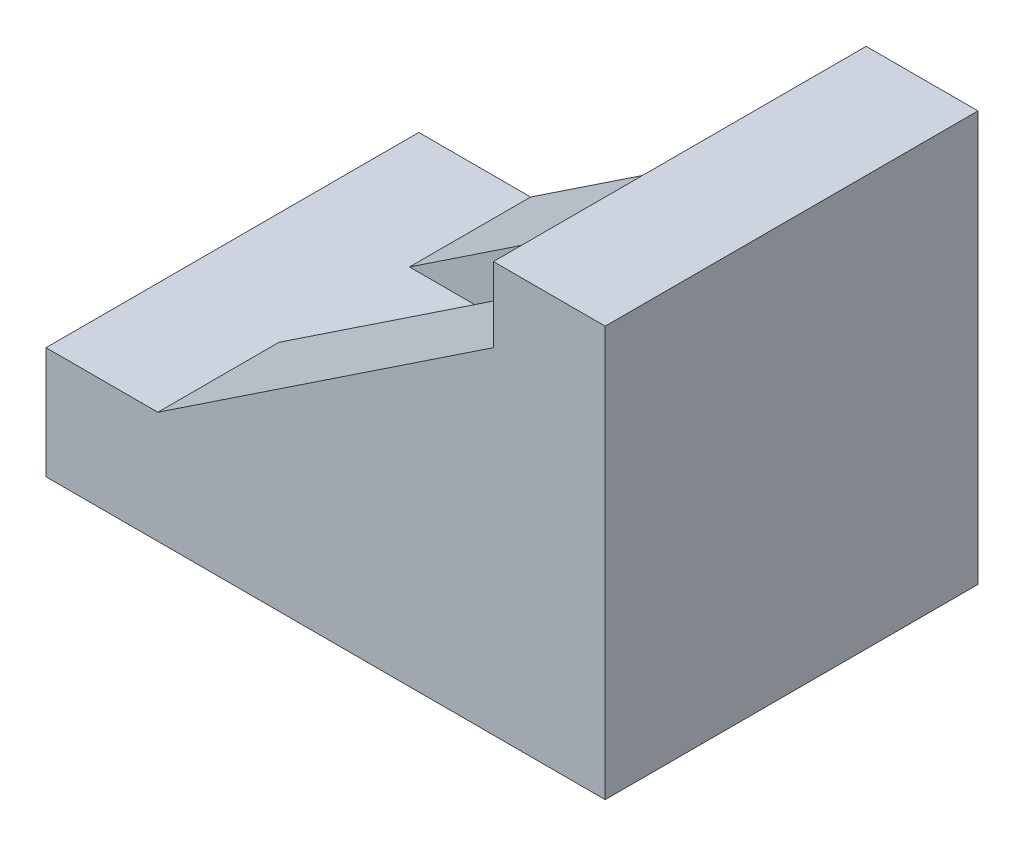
ISO-10303-21;
HEADER;
FILE_DESCRIPTION(('STEP AP214'),'2;1');
FILE_NAME('part.step','',(''),(''),'','','');
FILE_SCHEMA(('AUTOMOTIVE_DESIGN { 1 0 10303 214 1 1 1 1 }'));
ENDSEC;
DATA;
#1=APPLICATION_CONTEXT('core data for automotive mechanical design processes');
#2=APPLICATION_PROTOCOL_DEFINITION('international standard','automotive_design',2000,#1);
#3=PRODUCT_CONTEXT('',#1,'mechanical');
#4=PRODUCT('Part','Part','',(#3));
#5=PRODUCT_RELATED_PRODUCT_CATEGORY('part','',(#4));
#6=PRODUCT_DEFINITION_FORMATION('','',#4);
#7=PRODUCT_DEFINITION_CONTEXT('part definition',#1,'design');
#8=PRODUCT_DEFINITION('design','',#6,#7);
#9=PRODUCT_DEFINITION_SHAPE('','',#8);
#10=(LENGTH_UNIT() NAMED_UNIT(*) SI_UNIT(.MILLI.,.METRE.));
#11=(NAMED_UNIT(*) PLANE_ANGLE_UNIT() SI_UNIT($,.RADIAN.));
#12=(NAMED_UNIT(*) SI_UNIT($,.STERADIAN.) SOLID_ANGLE_UNIT());
#13=UNCERTAINTY_MEASURE_WITH_UNIT(LENGTH_MEASURE(1.E-05),#10,'distance_accuracy_value','');
#14=(GEOMETRIC_REPRESENTATION_CONTEXT(3) GLOBAL_UNCERTAINTY_ASSIGNED_CONTEXT((#13)) GLOBAL_UNIT_ASSIGNED_CONTEXT((#10,
#11,#12)) REPRESENTATION_CONTEXT('',''));
#15=CARTESIAN_POINT('',(0.,0.,0.));
#16=DIRECTION('',(0.,0.,1.));
#17=DIRECTION('',(1.,0.,0.));
#18=AXIS2_PLACEMENT_3D('',#15,#16,#17);
#19=CARTESIAN_POINT('',(24.,18.,10.));
#20=DIRECTION('',(0.554700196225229,-0.832050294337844,0.));
#21=DIRECTION('',(0.832050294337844,0.554700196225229,0.));
#22=AXIS2_PLACEMENT_3D('',#19,#20,#21);
#23=PLANE('',#22);
#24=DIRECTION('',(-0.832050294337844,-0.554700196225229,0.));
#25=VECTOR('',#24,1.);
#26=CARTESIAN_POINT('',(24.,18.,-3.5));
#27=LINE('',#26,#25);
#28=CARTESIAN_POINT('',(24.,18.,-3.5));
#29=VERTEX_POINT('',#28);
#30=CARTESIAN_POINT('',(6.,6.,-3.5));
#31=VERTEX_POINT('',#30);
#32=EDGE_CURVE('E46',#29,#31,#27,.T.);
#33=ORIENTED_EDGE('',*,*,#32,.F.);
#34=DIRECTION('',(0.,0.,-1.));
#35=VECTOR('',#34,1.);
#36=CARTESIAN_POINT('',(24.,18.,10.));
#37=LINE('',#36,#35);
#38=CARTESIAN_POINT('',(24.,18.,-10.));
#39=VERTEX_POINT('',#38);
#40=EDGE_CURVE('E128',#29,#39,#37,.T.);
#41=ORIENTED_EDGE('',*,*,#40,.T.);
#42=DIRECTION('',(-0.832050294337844,-0.554700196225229,0.));
#43=VECTOR('',#42,1.);
#44=CARTESIAN_POINT('',(24.,18.,-10.));
#45=LINE('',#44,#43);
#46=CARTESIAN_POINT('',(6.,6.,-10.));
#47=VERTEX_POINT('',#46);
#48=EDGE_CURVE('E150',#39,#47,#45,.T.);
#49=ORIENTED_EDGE('',*,*,#48,.T.);
#50=DIRECTION('',(0.,0.,-1.));
#51=VECTOR('',#50,1.);
#52=CARTESIAN_POINT('',(6.,6.,10.));
#53=LINE('',#52,#51);
#54=EDGE_CURVE('E156',#31,#47,#53,.T.);
#55=ORIENTED_EDGE('',*,*,#54,.F.);
#56=EDGE_LOOP('',(#33,#41,#49,#55));
#57=FACE_BOUND('',#56,.T.);
#58=ADVANCED_FACE('F31',(#57),#23,.F.);
#59=CARTESIAN_POINT('',(0.,0.,10.));
#60=DIRECTION('',(1.,0.,0.));
#61=DIRECTION('',(0.,0.,-1.));
#62=AXIS2_PLACEMENT_3D('',#59,#60,#61);
#63=PLANE('',#62);
#64=DIRECTION('',(0.,-1.,0.));
#65=VECTOR('',#64,1.);
#66=CARTESIAN_POINT('',(0.,0.,-10.));
#67=LINE('',#66,#65);
#68=CARTESIAN_POINT('',(0.,6.,-10.));
#69=VERTEX_POINT('',#68);
#70=CARTESIAN_POINT('',(0.,0.,-10.));
#71=VERTEX_POINT('',#70);
#72=EDGE_CURVE('E138',#69,#71,#67,.T.);
#73=ORIENTED_EDGE('',*,*,#72,.T.);
#74=DIRECTION('',(0.,0.,-1.));
#75=VECTOR('',#74,1.);
#76=CARTESIAN_POINT('',(0.,0.,10.));
#77=LINE('',#76,#75);
#78=CARTESIAN_POINT('',(0.,0.,10.));
#79=VERTEX_POINT('',#78);
#80=EDGE_CURVE('E11',#79,#71,#77,.T.);
#81=ORIENTED_EDGE('',*,*,#80,.F.);
#82=DIRECTION('',(0.,-1.,0.));
#83=VECTOR('',#82,1.);
#84=CARTESIAN_POINT('',(0.,0.,10.));
#85=LINE('',#84,#83);
#86=CARTESIAN_POINT('',(0.,6.,10.));
#87=VERTEX_POINT('',#86);
#88=EDGE_CURVE('E154',#87,#79,#85,.T.);
#89=ORIENTED_EDGE('',*,*,#88,.F.);
#90=DIRECTION('',(0.,0.,-1.));
#91=VECTOR('',#90,1.);
#92=CARTESIAN_POINT('',(0.,6.,10.));
#93=LINE('',#92,#91);
#94=EDGE_CURVE('E134',#87,#69,#93,.T.);
#95=ORIENTED_EDGE('',*,*,#94,.T.);
#96=EDGE_LOOP('',(#73,#81,#89,#95));
#97=FACE_BOUND('',#96,.T.);
#98=ADVANCED_FACE('F33',(#97),#63,.F.);
#99=CARTESIAN_POINT('',(0.,0.,10.));
#100=DIRECTION('',(0.,1.,0.));
#101=DIRECTION('',(0.,0.,1.));
#102=AXIS2_PLACEMENT_3D('',#99,#100,#101);
#103=PLANE('',#102);
#104=DIRECTION('',(1.,0.,0.));
#105=VECTOR('',#104,1.);
#106=CARTESIAN_POINT('',(0.,0.,-10.));
#107=LINE('',#106,#105);
#108=CARTESIAN_POINT('',(30.,0.,-10.));
#109=VERTEX_POINT('',#108);
#110=EDGE_CURVE('E141',#71,#109,#107,.T.);
#111=ORIENTED_EDGE('',*,*,#110,.T.);
#112=DIRECTION('',(0.,0.,-1.));
#113=VECTOR('',#112,1.);
#114=CARTESIAN_POINT('',(30.,0.,10.));
#115=LINE('',#114,#113);
#116=CARTESIAN_POINT('',(30.,0.,10.));
#117=VERTEX_POINT('',#116);
#118=EDGE_CURVE('E39',#117,#109,#115,.T.);
#119=ORIENTED_EDGE('',*,*,#118,.F.);
#120=DIRECTION('',(1.,0.,0.));
#121=VECTOR('',#120,1.);
#122=CARTESIAN_POINT('',(0.,0.,10.));
#123=LINE('',#122,#121);
#124=EDGE_CURVE('E92',#79,#117,#123,.T.);
#125=ORIENTED_EDGE('',*,*,#124,.F.);
#126=ORIENTED_EDGE('',*,*,#80,.T.);
#127=EDGE_LOOP('',(#111,#119,#125,#126));
#128=FACE_BOUND('',#127,.T.);
#129=ADVANCED_FACE('F200',(#128),#103,.F.);
#130=CARTESIAN_POINT('',(30.,0.,10.));
#131=DIRECTION('',(-1.,0.,0.));
#132=DIRECTION('',(0.,0.,1.));
#133=AXIS2_PLACEMENT_3D('',#130,#131,#132);
#134=PLANE('',#133);
#135=DIRECTION('',(0.,1.,0.));
#136=VECTOR('',#135,1.);
#137=CARTESIAN_POINT('',(30.,0.,-10.));
#138=LINE('',#137,#136);
#139=CARTESIAN_POINT('',(30.,22.,-10.));
#140=VERTEX_POINT('',#139);
#141=EDGE_CURVE('E144',#109,#140,#138,.T.);
#142=ORIENTED_EDGE('',*,*,#141,.T.);
#143=DIRECTION('',(0.,0.,-1.));
#144=VECTOR('',#143,1.);
#145=CARTESIAN_POINT('',(30.,22.,10.));
#146=LINE('',#145,#144);
#147=CARTESIAN_POINT('',(30.,22.,10.));
#148=VERTEX_POINT('',#147);
#149=EDGE_CURVE('E159',#148,#140,#146,.T.);
#150=ORIENTED_EDGE('',*,*,#149,.F.);
#151=DIRECTION('',(0.,1.,0.));
#152=VECTOR('',#151,1.);
#153=CARTESIAN_POINT('',(30.,0.,10.));
#154=LINE('',#153,#152);
#155=EDGE_CURVE('E167',#117,#148,#154,.T.);
#156=ORIENTED_EDGE('',*,*,#155,.F.);
#157=ORIENTED_EDGE('',*,*,#118,.T.);
#158=EDGE_LOOP('',(#142,#150,#156,#157));
#159=FACE_BOUND('',#158,.T.);
#160=ADVANCED_FACE('F165',(#159),#134,.F.);
#161=CARTESIAN_POINT('',(30.,22.,10.));
#162=DIRECTION('',(0.,-1.,0.));
#163=DIRECTION('',(0.,0.,-1.));
#164=AXIS2_PLACEMENT_3D('',#161,#162,#163);
#165=PLANE('',#164);
#166=DIRECTION('',(-1.,0.,0.));
#167=VECTOR('',#166,1.);
#168=CARTESIAN_POINT('',(30.,22.,-10.));
#169=LINE('',#168,#167);
#170=CARTESIAN_POINT('',(24.,22.,-10.));
#171=VERTEX_POINT('',#170);
#172=EDGE_CURVE('E146',#140,#171,#169,.T.);
#173=ORIENTED_EDGE('',*,*,#172,.T.);
#174=DIRECTION('',(0.,0.,-1.));
#175=VECTOR('',#174,1.);
#176=CARTESIAN_POINT('',(24.,22.,10.));
#177=LINE('',#176,#175);
#178=CARTESIAN_POINT('',(24.,22.,10.));
#179=VERTEX_POINT('',#178);
#180=EDGE_CURVE('E127',#179,#171,#177,.T.);
#181=ORIENTED_EDGE('',*,*,#180,.F.);
#182=DIRECTION('',(-1.,0.,0.));
#183=VECTOR('',#182,1.);
#184=CARTESIAN_POINT('',(30.,22.,10.));
#185=LINE('',#184,#183);
#186=EDGE_CURVE('E112',#148,#179,#185,.T.);
#187=ORIENTED_EDGE('',*,*,#186,.F.);
#188=ORIENTED_EDGE('',*,*,#149,.T.);
#189=EDGE_LOOP('',(#173,#181,#187,#188));
#190=FACE_BOUND('',#189,.T.);
#191=ADVANCED_FACE('F175',(#190),#165,.F.);
#192=CARTESIAN_POINT('',(24.,22.,10.));
#193=DIRECTION('',(1.,0.,0.));
#194=DIRECTION('',(0.,0.,-1.));
#195=AXIS2_PLACEMENT_3D('',#192,#193,#194);
#196=PLANE('',#195);
#197=DIRECTION('',(0.,-1.,0.));
#198=VECTOR('',#197,1.);
#199=CARTESIAN_POINT('',(24.,22.,-10.));
#200=LINE('',#199,#198);
#201=EDGE_CURVE('E148',#171,#39,#200,.T.);
#202=ORIENTED_EDGE('',*,*,#201,.T.);
#203=ORIENTED_EDGE('',*,*,#40,.F.);
#204=DIRECTION('',(0.,1.,0.));
#205=VECTOR('',#204,1.);
#206=CARTESIAN_POINT('',(24.,18.,-3.5));
#207=LINE('',#206,#205);
#208=CARTESIAN_POINT('',(24.,6.,-3.5));
#209=VERTEX_POINT('',#208);
#210=EDGE_CURVE('E184',#209,#29,#207,.T.);
#211=ORIENTED_EDGE('',*,*,#210,.F.);
#212=DIRECTION('',(0.,0.,1.));
#213=VECTOR('',#212,1.);
#214=CARTESIAN_POINT('',(24.,6.,-3.5));
#215=LINE('',#214,#213);
#216=CARTESIAN_POINT('',(24.,6.,3.5));
#217=VERTEX_POINT('',#216);
#218=EDGE_CURVE('E142',#209,#217,#215,.T.);
#219=ORIENTED_EDGE('',*,*,#218,.T.);
#220=DIRECTION('',(0.,1.,0.));
#221=VECTOR('',#220,1.);
#222=CARTESIAN_POINT('',(24.,18.,3.5));
#223=LINE('',#222,#221);
#224=CARTESIAN_POINT('',(24.,18.,3.5));
#225=VERTEX_POINT('',#224);
#226=EDGE_CURVE('E124',#217,#225,#223,.T.);
#227=ORIENTED_EDGE('',*,*,#226,.T.);
#228=CARTESIAN_POINT('',(24.,18.,10.));
#229=VERTEX_POINT('',#228);
#230=EDGE_CURVE('E119',#229,#225,#37,.T.);
#231=ORIENTED_EDGE('',*,*,#230,.F.);
#232=DIRECTION('',(0.,-1.,0.));
#233=VECTOR('',#232,1.);
#234=CARTESIAN_POINT('',(24.,22.,10.));
#235=LINE('',#234,#233);
#236=EDGE_CURVE('E105',#179,#229,#235,.T.);
#237=ORIENTED_EDGE('',*,*,#236,.F.);
#238=ORIENTED_EDGE('',*,*,#180,.T.);
#239=EDGE_LOOP('',(#202,#203,#211,#219,#227,#231,#237,#238));
#240=FACE_BOUND('',#239,.T.);
#241=ADVANCED_FACE('F121',(#240),#196,.F.);
#242=ORIENTED_EDGE('',*,*,#230,.T.);
#243=DIRECTION('',(-0.832050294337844,-0.554700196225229,0.));
#244=VECTOR('',#243,1.);
#245=CARTESIAN_POINT('',(24.,18.,3.5));
#246=LINE('',#245,#244);
#247=CARTESIAN_POINT('',(6.,6.,3.5));
#248=VERTEX_POINT('',#247);
#249=EDGE_CURVE('E190',#225,#248,#246,.T.);
#250=ORIENTED_EDGE('',*,*,#249,.T.);
#251=CARTESIAN_POINT('',(6.,6.,10.));
#252=VERTEX_POINT('',#251);
#253=EDGE_CURVE('E132',#252,#248,#53,.T.);
#254=ORIENTED_EDGE('',*,*,#253,.F.);
#255=DIRECTION('',(-0.832050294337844,-0.554700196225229,0.));
#256=VECTOR('',#255,1.);
#257=CARTESIAN_POINT('',(24.,18.,10.));
#258=LINE('',#257,#256);
#259=EDGE_CURVE('E109',#229,#252,#258,.T.);
#260=ORIENTED_EDGE('',*,*,#259,.F.);
#261=EDGE_LOOP('',(#242,#250,#254,#260));
#262=FACE_BOUND('',#261,.T.);
#263=ADVANCED_FACE('F130',(#262),#23,.F.);
#264=CARTESIAN_POINT('',(0.,6.,10.));
#265=DIRECTION('',(0.,-1.,0.));
#266=DIRECTION('',(0.,0.,-1.));
#267=AXIS2_PLACEMENT_3D('',#264,#265,#266);
#268=PLANE('',#267);
#269=DIRECTION('',(-1.,0.,0.));
#270=VECTOR('',#269,1.);
#271=CARTESIAN_POINT('',(0.,6.,-10.));
#272=LINE('',#271,#270);
#273=EDGE_CURVE('E84',#47,#69,#272,.T.);
#274=ORIENTED_EDGE('',*,*,#273,.T.);
#275=ORIENTED_EDGE('',*,*,#94,.F.);
#276=DIRECTION('',(-1.,0.,0.));
#277=VECTOR('',#276,1.);
#278=CARTESIAN_POINT('',(0.,6.,10.));
#279=LINE('',#278,#277);
#280=EDGE_CURVE('E55',#252,#87,#279,.T.);
#281=ORIENTED_EDGE('',*,*,#280,.F.);
#282=ORIENTED_EDGE('',*,*,#253,.T.);
#283=DIRECTION('',(1.,0.,0.));
#284=VECTOR('',#283,1.);
#285=CARTESIAN_POINT('',(24.,6.,3.5));
#286=LINE('',#285,#284);
#287=EDGE_CURVE('E186',#248,#217,#286,.T.);
#288=ORIENTED_EDGE('',*,*,#287,.T.);
#289=ORIENTED_EDGE('',*,*,#218,.F.);
#290=DIRECTION('',(1.,0.,0.));
#291=VECTOR('',#290,1.);
#292=CARTESIAN_POINT('',(24.,6.,-3.5));
#293=LINE('',#292,#291);
#294=EDGE_CURVE('E182',#31,#209,#293,.T.);
#295=ORIENTED_EDGE('',*,*,#294,.F.);
#296=ORIENTED_EDGE('',*,*,#54,.T.);
#297=EDGE_LOOP('',(#274,#275,#281,#282,#288,#289,#295,#296));
#298=FACE_BOUND('',#297,.T.);
#299=ADVANCED_FACE('F214',(#298),#268,.F.);
#300=CARTESIAN_POINT('',(0.,6.,10.));
#301=DIRECTION('',(0.,0.,-1.));
#302=DIRECTION('',(-1.,0.,0.));
#303=AXIS2_PLACEMENT_3D('',#300,#301,#302);
#304=PLANE('',#303);
#305=ORIENTED_EDGE('',*,*,#88,.T.);
#306=ORIENTED_EDGE('',*,*,#124,.T.);
#307=ORIENTED_EDGE('',*,*,#155,.T.);
#308=ORIENTED_EDGE('',*,*,#186,.T.);
#309=ORIENTED_EDGE('',*,*,#236,.T.);
#310=ORIENTED_EDGE('',*,*,#259,.T.);
#311=ORIENTED_EDGE('',*,*,#280,.T.);
#312=EDGE_LOOP('',(#305,#306,#307,#308,#309,#310,#311));
#313=FACE_BOUND('',#312,.T.);
#314=ADVANCED_FACE('F107',(#313),#304,.F.);
#315=CARTESIAN_POINT('',(0.,6.,-10.));
#316=DIRECTION('',(0.,0.,-1.));
#317=DIRECTION('',(-1.,0.,0.));
#318=AXIS2_PLACEMENT_3D('',#315,#316,#317);
#319=PLANE('',#318);
#320=ORIENTED_EDGE('',*,*,#72,.F.);
#321=ORIENTED_EDGE('',*,*,#273,.F.);
#322=ORIENTED_EDGE('',*,*,#48,.F.);
#323=ORIENTED_EDGE('',*,*,#201,.F.);
#324=ORIENTED_EDGE('',*,*,#172,.F.);
#325=ORIENTED_EDGE('',*,*,#141,.F.);
#326=ORIENTED_EDGE('',*,*,#110,.F.);
#327=EDGE_LOOP('',(#320,#321,#322,#323,#324,#325,#326));
#328=FACE_BOUND('',#327,.T.);
#329=ADVANCED_FACE('F171',(#328),#319,.T.);
#330=CARTESIAN_POINT('',(24.,18.,-3.5));
#331=DIRECTION('',(0.,0.,1.));
#332=DIRECTION('',(1.,0.,0.));
#333=AXIS2_PLACEMENT_3D('',#330,#331,#332);
#334=PLANE('',#333);
#335=ORIENTED_EDGE('',*,*,#32,.T.);
#336=ORIENTED_EDGE('',*,*,#294,.T.);
#337=ORIENTED_EDGE('',*,*,#210,.T.);
#338=EDGE_LOOP('',(#335,#336,#337));
#339=FACE_BOUND('',#338,.T.);
#340=ADVANCED_FACE('F276',(#339),#334,.T.);
#341=CARTESIAN_POINT('',(24.,18.,3.5));
#342=DIRECTION('',(0.,0.,1.));
#343=DIRECTION('',(1.,0.,0.));
#344=AXIS2_PLACEMENT_3D('',#341,#342,#343);
#345=PLANE('',#344);
#346=ORIENTED_EDGE('',*,*,#249,.F.);
#347=ORIENTED_EDGE('',*,*,#226,.F.);
#348=ORIENTED_EDGE('',*,*,#287,.F.);
#349=EDGE_LOOP('',(#346,#347,#348));
#350=FACE_BOUND('',#349,.T.);
#351=ADVANCED_FACE('F289',(#350),#345,.F.);
#352=CLOSED_SHELL('',(#58,#98,#129,#160,#191,#241,#263,#299,#314,#329,#340,#351));
#353=MANIFOLD_SOLID_BREP('B2',#352);
#354=ADVANCED_BREP_SHAPE_REPRESENTATION('',(#18,#353),#14);
#355=SHAPE_DEFINITION_REPRESENTATION(#9,#354);
ENDSEC;
END-ISO-10303-21;
